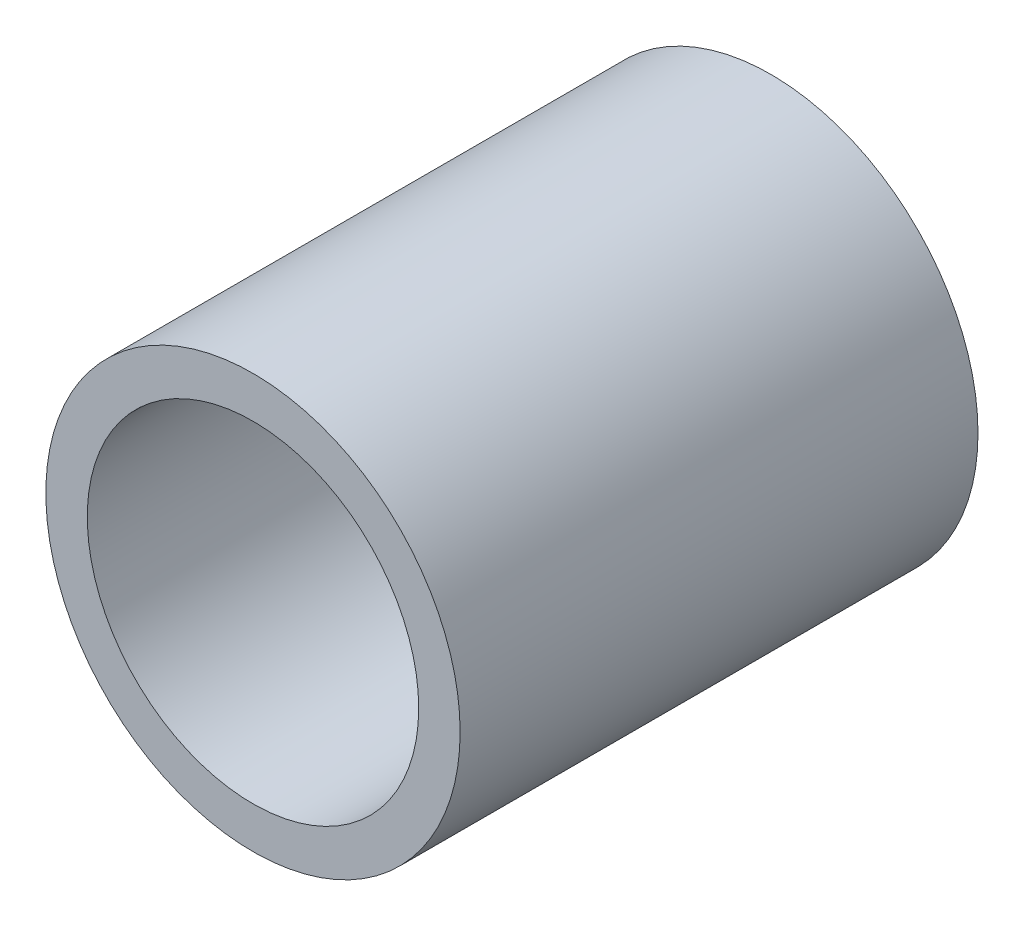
from build123d import *

# Parameters (mm, degrees)
ESQUISSE1_R             = 2
BASE_EXTRUSION_DEPTH    = 5
ESQUISSE2_R             = 1.6
ENL_V_MAT_EXTRU_1_DEPTH = 6.744562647


with BuildPart() as part:
    # Esquisse1 → Base-Extrusion (new body)
    with BuildSketch(Plane.XY):
        Circle(ESQUISSE1_R)
    extrude(amount=BASE_EXTRUSION_DEPTH)

    # Esquisse2 → Enl_v. mat.-Extru.1 (cut, through all)
    with BuildSketch(Plane.XY.offset(5)):
        Circle(ESQUISSE2_R)
    extrude(amount=-ENL_V_MAT_EXTRU_1_DEPTH, mode=Mode.SUBTRACT)


solid = part.part
